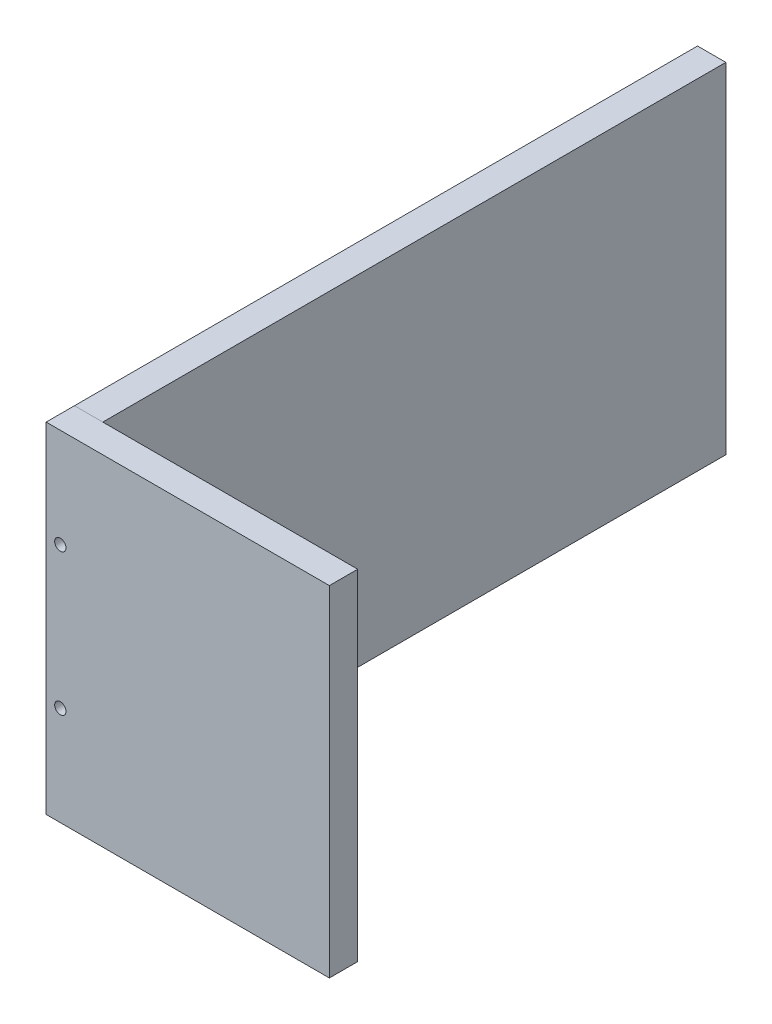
from build123d import *

# Parameters (mm, degrees)
SKETCH1_W           = 10
SKETCH1_H           = 220
BOSS_EXTRUDE1_DEPTH = 120
SKETCH1_3_W         = 100
SKETCH1_3_H         = 10
BOSS_EXTRUDE2_DEPTH = 120
SKETCH2_R           = 2
CUT_EXTRUDE1_DEPTH  = 30


with BuildPart() as part:
    # Sketch1 → Boss-Extrude1 (new body)
    with BuildSketch(Plane(origin=(0, 0, 0), x_dir=(1, 0, 0), z_dir=(0, 1, 0))):
        with Locations((5, 110)):
            Rectangle(SKETCH1_W, SKETCH1_H)
    extrude(amount=BOSS_EXTRUDE1_DEPTH)


with BuildPart() as body_2:
    # Sketch1_3 → Boss-Extrude2 (new body)
    with BuildSketch(Plane(origin=(0, 0, 0), x_dir=(1, 0, 0), z_dir=(0, 1, 0))):
        with Locations((50, -5)):
            Rectangle(SKETCH1_3_W, SKETCH1_3_H)
    extrude(amount=BOSS_EXTRUDE2_DEPTH)


with BuildPart() as cut_extrude1_tool:
    # Sketch2 → Cut-Extrude1 (new body)
    with BuildSketch(Plane.XY.offset(10)):
        with Locations((5, 85)):
            Circle(SKETCH2_R)
        with Locations((5, 35)):
            Circle(SKETCH2_R)
    extrude(amount=-CUT_EXTRUDE1_DEPTH)


with BuildPart() as part_1:
    add(part.part)

    # Cut-Extrude1: cut by cut_extrude1_tool
    add(cut_extrude1_tool.part, mode=Mode.SUBTRACT)


with BuildPart() as body_2_1:
    add(body_2.part)

    # Cut-Extrude1: cut by cut_extrude1_tool
    add(cut_extrude1_tool.part, mode=Mode.SUBTRACT)


solid = Compound([part_1.part, body_2_1.part])
